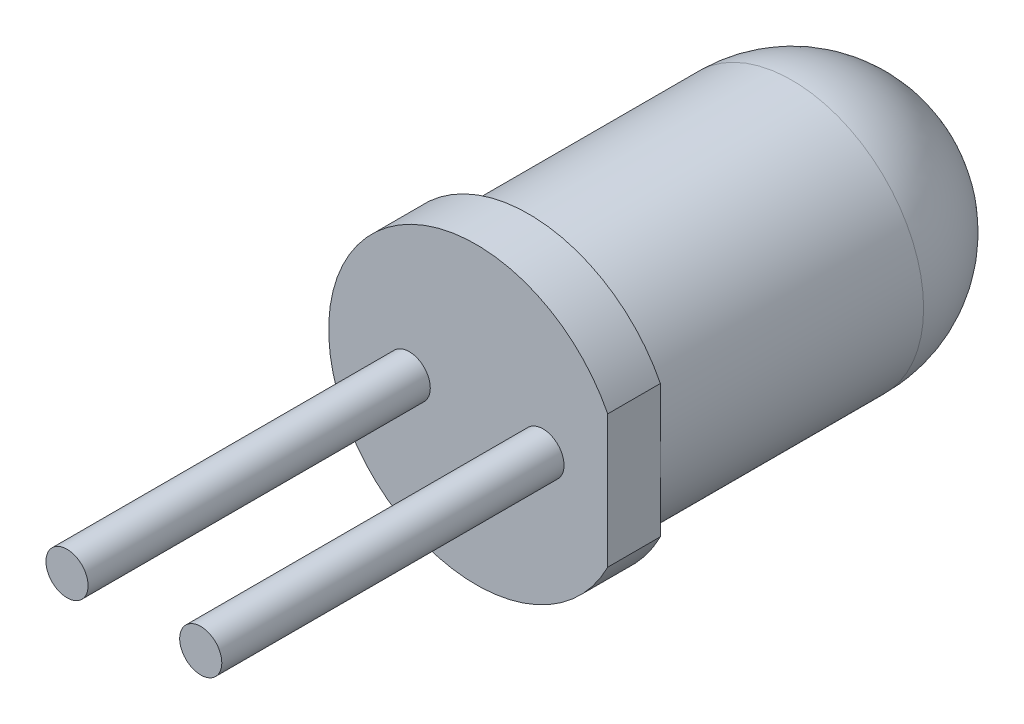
ISO-10303-21;
HEADER;
FILE_DESCRIPTION(('STEP AP214'),'2;1');
FILE_NAME('part.step','',(''),(''),'','','');
FILE_SCHEMA(('AUTOMOTIVE_DESIGN { 1 0 10303 214 1 1 1 1 }'));
ENDSEC;
DATA;
#1=APPLICATION_CONTEXT('core data for automotive mechanical design processes');
#2=APPLICATION_PROTOCOL_DEFINITION('international standard','automotive_design',2000,#1);
#3=PRODUCT_CONTEXT('',#1,'mechanical');
#4=PRODUCT('Part','Part','',(#3));
#5=PRODUCT_RELATED_PRODUCT_CATEGORY('part','',(#4));
#6=PRODUCT_DEFINITION_FORMATION('','',#4);
#7=PRODUCT_DEFINITION_CONTEXT('part definition',#1,'design');
#8=PRODUCT_DEFINITION('design','',#6,#7);
#9=PRODUCT_DEFINITION_SHAPE('','',#8);
#10=(LENGTH_UNIT() NAMED_UNIT(*) SI_UNIT(.MILLI.,.METRE.));
#11=(NAMED_UNIT(*) PLANE_ANGLE_UNIT() SI_UNIT($,.RADIAN.));
#12=(NAMED_UNIT(*) SI_UNIT($,.STERADIAN.) SOLID_ANGLE_UNIT());
#13=UNCERTAINTY_MEASURE_WITH_UNIT(LENGTH_MEASURE(1.E-05),#10,'distance_accuracy_value','');
#14=(GEOMETRIC_REPRESENTATION_CONTEXT(3) GLOBAL_UNCERTAINTY_ASSIGNED_CONTEXT((#13)) GLOBAL_UNIT_ASSIGNED_CONTEXT((#10,
#11,#12)) REPRESENTATION_CONTEXT('',''));
#15=CARTESIAN_POINT('',(0.,0.,0.));
#16=DIRECTION('',(0.,0.,1.));
#17=DIRECTION('',(1.,0.,0.));
#18=AXIS2_PLACEMENT_3D('',#15,#16,#17);
#19=CARTESIAN_POINT('',(0.,0.,8.5));
#20=DIRECTION('',(0.,0.,-1.));
#21=DIRECTION('',(-1.,0.,0.));
#22=AXIS2_PLACEMENT_3D('',#19,#20,#21);
#23=CYLINDRICAL_SURFACE('',#22,2.5);
#24=CARTESIAN_POINT('',(0.,0.,2.5));
#25=DIRECTION('',(0.,0.,-1.));
#26=DIRECTION('',(-1.,0.,0.));
#27=AXIS2_PLACEMENT_3D('',#24,#25,#26);
#28=CIRCLE('',#27,2.5);
#29=CARTESIAN_POINT('',(-2.5,0.,2.5));
#30=VERTEX_POINT('',#29);
#31=EDGE_CURVE('E11',#30,#30,#28,.F.);
#32=ORIENTED_EDGE('',*,*,#31,.T.);
#33=EDGE_LOOP('',(#32));
#34=FACE_BOUND('',#33,.T.);
#35=CARTESIAN_POINT('',(0.,0.,7.5));
#36=DIRECTION('',(0.,0.,1.));
#37=DIRECTION('',(1.,0.,0.));
#38=AXIS2_PLACEMENT_3D('',#35,#36,#37);
#39=CIRCLE('',#38,2.5);
#40=CARTESIAN_POINT('',(2.5,0.,7.5));
#41=VERTEX_POINT('',#40);
#42=EDGE_CURVE('E43',#41,#41,#39,.T.);
#43=ORIENTED_EDGE('',*,*,#42,.F.);
#44=EDGE_LOOP('',(#43));
#45=FACE_BOUND('',#44,.T.);
#46=ADVANCED_FACE('F36',(#34,#45),#23,.T.);
#47=CARTESIAN_POINT('',(0.,0.,7.5));
#48=DIRECTION('',(0.,0.,1.));
#49=DIRECTION('',(1.,0.,0.));
#50=AXIS2_PLACEMENT_3D('',#47,#48,#49);
#51=PLANE('',#50);
#52=DIRECTION('',(0.,1.,0.));
#53=VECTOR('',#52,1.);
#54=CARTESIAN_POINT('',(2.5,1.26095202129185,7.5));
#55=LINE('',#54,#53);
#56=CARTESIAN_POINT('',(2.5,1.26095202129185,7.5));
#57=VERTEX_POINT('',#56);
#58=EDGE_CURVE('E54',#41,#57,#55,.T.);
#59=ORIENTED_EDGE('',*,*,#58,.F.);
#60=ORIENTED_EDGE('',*,*,#42,.T.);
#61=CARTESIAN_POINT('',(2.5,-1.26095202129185,7.5));
#62=VERTEX_POINT('',#61);
#63=EDGE_CURVE('E76',#62,#41,#55,.T.);
#64=ORIENTED_EDGE('',*,*,#63,.F.);
#65=CARTESIAN_POINT('',(0.,0.,7.5));
#66=DIRECTION('',(0.,0.,1.));
#67=DIRECTION('',(1.,0.,0.));
#68=AXIS2_PLACEMENT_3D('',#65,#66,#67);
#69=CIRCLE('',#68,2.8);
#70=EDGE_CURVE('E72',#57,#62,#69,.T.);
#71=ORIENTED_EDGE('',*,*,#70,.F.);
#72=EDGE_LOOP('',(#59,#60,#64,#71));
#73=FACE_BOUND('',#72,.T.);
#74=ADVANCED_FACE('F90',(#73),#51,.F.);
#75=CARTESIAN_POINT('',(2.5,1.26095202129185,7.5));
#76=DIRECTION('',(1.,0.,0.));
#77=DIRECTION('',(0.,0.,-1.));
#78=AXIS2_PLACEMENT_3D('',#75,#76,#77);
#79=PLANE('',#78);
#80=ORIENTED_EDGE('',*,*,#63,.T.);
#81=ORIENTED_EDGE('',*,*,#58,.T.);
#82=DIRECTION('',(0.,0.,1.));
#83=VECTOR('',#82,1.);
#84=CARTESIAN_POINT('',(2.5,1.26095202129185,7.5));
#85=LINE('',#84,#83);
#86=CARTESIAN_POINT('',(2.5,1.26095202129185,8.5));
#87=VERTEX_POINT('',#86);
#88=EDGE_CURVE('E75',#57,#87,#85,.T.);
#89=ORIENTED_EDGE('',*,*,#88,.T.);
#90=DIRECTION('',(0.,1.,0.));
#91=VECTOR('',#90,1.);
#92=CARTESIAN_POINT('',(2.5,1.26095202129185,8.5));
#93=LINE('',#92,#91);
#94=CARTESIAN_POINT('',(2.5,-1.26095202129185,8.5));
#95=VERTEX_POINT('',#94);
#96=EDGE_CURVE('E80',#95,#87,#93,.T.);
#97=ORIENTED_EDGE('',*,*,#96,.F.);
#98=DIRECTION('',(0.,0.,1.));
#99=VECTOR('',#98,1.);
#100=CARTESIAN_POINT('',(2.5,-1.26095202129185,7.5));
#101=LINE('',#100,#99);
#102=EDGE_CURVE('E67',#62,#95,#101,.T.);
#103=ORIENTED_EDGE('',*,*,#102,.F.);
#104=EDGE_LOOP('',(#80,#81,#89,#97,#103));
#105=FACE_BOUND('',#104,.T.);
#106=ADVANCED_FACE('F83',(#105),#79,.T.);
#107=CARTESIAN_POINT('',(0.,0.,7.5));
#108=DIRECTION('',(0.,0.,1.));
#109=DIRECTION('',(1.,0.,0.));
#110=AXIS2_PLACEMENT_3D('',#107,#108,#109);
#111=CYLINDRICAL_SURFACE('',#110,2.8);
#112=CARTESIAN_POINT('',(0.,0.,8.5));
#113=DIRECTION('',(0.,0.,1.));
#114=DIRECTION('',(1.,0.,0.));
#115=AXIS2_PLACEMENT_3D('',#112,#113,#114);
#116=CIRCLE('',#115,2.8);
#117=EDGE_CURVE('E70',#87,#95,#116,.T.);
#118=ORIENTED_EDGE('',*,*,#117,.F.);
#119=ORIENTED_EDGE('',*,*,#88,.F.);
#120=ORIENTED_EDGE('',*,*,#70,.T.);
#121=ORIENTED_EDGE('',*,*,#102,.T.);
#122=EDGE_LOOP('',(#118,#119,#120,#121));
#123=FACE_BOUND('',#122,.T.);
#124=ADVANCED_FACE('F69',(#123),#111,.T.);
#125=CARTESIAN_POINT('',(0.,0.,8.5));
#126=DIRECTION('',(0.,0.,1.));
#127=DIRECTION('',(1.,0.,0.));
#128=AXIS2_PLACEMENT_3D('',#125,#126,#127);
#129=PLANE('',#128);
#130=CARTESIAN_POINT('',(-1.27,0.,8.5));
#131=DIRECTION('',(0.,0.,1.));
#132=DIRECTION('',(1.,0.,0.));
#133=AXIS2_PLACEMENT_3D('',#130,#131,#132);
#134=CIRCLE('',#133,0.4);
#135=CARTESIAN_POINT('',(-0.87,0.,8.5));
#136=VERTEX_POINT('',#135);
#137=EDGE_CURVE('E114',#136,#136,#134,.T.);
#138=ORIENTED_EDGE('',*,*,#137,.F.);
#139=EDGE_LOOP('',(#138));
#140=FACE_BOUND('',#139,.T.);
#141=CARTESIAN_POINT('',(1.27,0.,8.5));
#142=DIRECTION('',(0.,0.,1.));
#143=DIRECTION('',(1.,0.,0.));
#144=AXIS2_PLACEMENT_3D('',#141,#142,#143);
#145=CIRCLE('',#144,0.4);
#146=CARTESIAN_POINT('',(1.67,0.,8.5));
#147=VERTEX_POINT('',#146);
#148=EDGE_CURVE('E117',#147,#147,#145,.T.);
#149=ORIENTED_EDGE('',*,*,#148,.F.);
#150=EDGE_LOOP('',(#149));
#151=FACE_BOUND('',#150,.T.);
#152=ORIENTED_EDGE('',*,*,#96,.T.);
#153=ORIENTED_EDGE('',*,*,#117,.T.);
#154=EDGE_LOOP('',(#152,#153));
#155=FACE_BOUND('',#154,.T.);
#156=ADVANCED_FACE('F79',(#140,#151,#155),#129,.T.);
#157=CARTESIAN_POINT('',(0.,0.,2.5));
#158=DIRECTION('',(0.,0.,1.));
#159=DIRECTION('',(1.,0.,0.));
#160=AXIS2_PLACEMENT_3D('',#157,#158,#159);
#161=SPHERICAL_SURFACE('',#160,2.5);
#162=ORIENTED_EDGE('',*,*,#31,.F.);
#163=EDGE_LOOP('',(#162));
#164=FACE_BOUND('',#163,.T.);
#165=ADVANCED_FACE('F100',(#164),#161,.T.);
#166=CARTESIAN_POINT('',(1.27,0.,15.));
#167=DIRECTION('',(0.,0.,-1.));
#168=DIRECTION('',(-1.,0.,0.));
#169=AXIS2_PLACEMENT_3D('',#166,#167,#168);
#170=CYLINDRICAL_SURFACE('',#169,0.4);
#171=CARTESIAN_POINT('',(1.27,0.,15.));
#172=DIRECTION('',(0.,0.,1.));
#173=DIRECTION('',(1.,0.,0.));
#174=AXIS2_PLACEMENT_3D('',#171,#172,#173);
#175=CIRCLE('',#174,0.4);
#176=CARTESIAN_POINT('',(1.67,0.,15.));
#177=VERTEX_POINT('',#176);
#178=EDGE_CURVE('E81',#177,#177,#175,.T.);
#179=ORIENTED_EDGE('',*,*,#178,.F.);
#180=EDGE_LOOP('',(#179));
#181=FACE_BOUND('',#180,.T.);
#182=ORIENTED_EDGE('',*,*,#148,.T.);
#183=EDGE_LOOP('',(#182));
#184=FACE_BOUND('',#183,.T.);
#185=ADVANCED_FACE('F109',(#181,#184),#170,.T.);
#186=CARTESIAN_POINT('',(0.,0.,15.));
#187=DIRECTION('',(0.,0.,1.));
#188=DIRECTION('',(1.,0.,0.));
#189=AXIS2_PLACEMENT_3D('',#186,#187,#188);
#190=PLANE('',#189);
#191=ORIENTED_EDGE('',*,*,#178,.T.);
#192=EDGE_LOOP('',(#191));
#193=FACE_BOUND('',#192,.T.);
#194=ADVANCED_FACE('F129',(#193),#190,.T.);
#195=CARTESIAN_POINT('',(-1.27,0.,15.));
#196=DIRECTION('',(0.,0.,-1.));
#197=DIRECTION('',(-1.,0.,0.));
#198=AXIS2_PLACEMENT_3D('',#195,#196,#197);
#199=CYLINDRICAL_SURFACE('',#198,0.4);
#200=CARTESIAN_POINT('',(-1.27,0.,15.));
#201=DIRECTION('',(0.,0.,1.));
#202=DIRECTION('',(1.,0.,0.));
#203=AXIS2_PLACEMENT_3D('',#200,#201,#202);
#204=CIRCLE('',#203,0.4);
#205=CARTESIAN_POINT('',(-0.87,0.,15.));
#206=VERTEX_POINT('',#205);
#207=EDGE_CURVE('E119',#206,#206,#204,.T.);
#208=ORIENTED_EDGE('',*,*,#207,.F.);
#209=EDGE_LOOP('',(#208));
#210=FACE_BOUND('',#209,.T.);
#211=ORIENTED_EDGE('',*,*,#137,.T.);
#212=EDGE_LOOP('',(#211));
#213=FACE_BOUND('',#212,.T.);
#214=ADVANCED_FACE('F126',(#210,#213),#199,.T.);
#215=CARTESIAN_POINT('',(-1.27,0.,15.));
#216=DIRECTION('',(0.,0.,1.));
#217=DIRECTION('',(1.,0.,0.));
#218=AXIS2_PLACEMENT_3D('',#215,#216,#217);
#219=PLANE('',#218);
#220=ORIENTED_EDGE('',*,*,#207,.T.);
#221=EDGE_LOOP('',(#220));
#222=FACE_BOUND('',#221,.T.);
#223=ADVANCED_FACE('F128',(#222),#219,.T.);
#224=CLOSED_SHELL('',(#46,#74,#106,#124,#156,#165,#185,#194,#214,#223));
#225=MANIFOLD_SOLID_BREP('B2',#224);
#226=ADVANCED_BREP_SHAPE_REPRESENTATION('',(#18,#225),#14);
#227=SHAPE_DEFINITION_REPRESENTATION(#9,#226);
ENDSEC;
END-ISO-10303-21;
